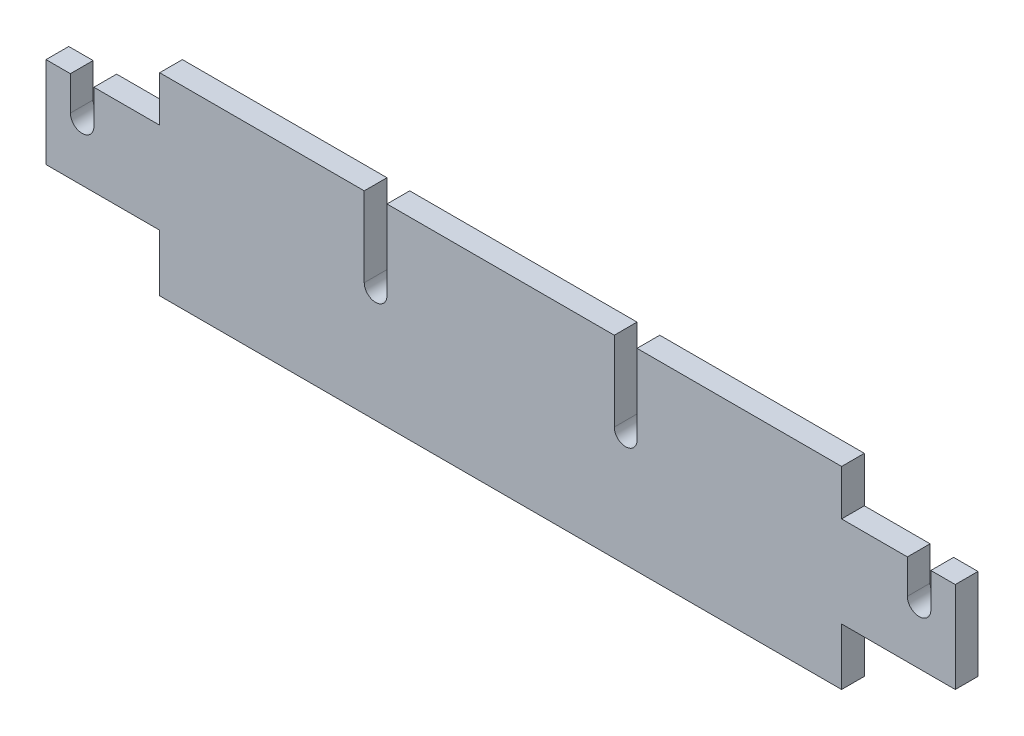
ISO-10303-21;
HEADER;
FILE_DESCRIPTION(('STEP AP214'),'2;1');
FILE_NAME('part.step','',(''),(''),'','','');
FILE_SCHEMA(('AUTOMOTIVE_DESIGN { 1 0 10303 214 1 1 1 1 }'));
ENDSEC;
DATA;
#1=APPLICATION_CONTEXT('core data for automotive mechanical design processes');
#2=APPLICATION_PROTOCOL_DEFINITION('international standard','automotive_design',2000,#1);
#3=PRODUCT_CONTEXT('',#1,'mechanical');
#4=PRODUCT('Part','Part','',(#3));
#5=PRODUCT_RELATED_PRODUCT_CATEGORY('part','',(#4));
#6=PRODUCT_DEFINITION_FORMATION('','',#4);
#7=PRODUCT_DEFINITION_CONTEXT('part definition',#1,'design');
#8=PRODUCT_DEFINITION('design','',#6,#7);
#9=PRODUCT_DEFINITION_SHAPE('','',#8);
#10=(LENGTH_UNIT() NAMED_UNIT(*) SI_UNIT(.MILLI.,.METRE.));
#11=(NAMED_UNIT(*) PLANE_ANGLE_UNIT() SI_UNIT($,.RADIAN.));
#12=(NAMED_UNIT(*) SI_UNIT($,.STERADIAN.) SOLID_ANGLE_UNIT());
#13=UNCERTAINTY_MEASURE_WITH_UNIT(LENGTH_MEASURE(1.E-05),#10,'distance_accuracy_value','');
#14=(GEOMETRIC_REPRESENTATION_CONTEXT(3) GLOBAL_UNCERTAINTY_ASSIGNED_CONTEXT((#13)) GLOBAL_UNIT_ASSIGNED_CONTEXT((#10,
#11,#12)) REPRESENTATION_CONTEXT('',''));
#15=CARTESIAN_POINT('',(0.,0.,0.));
#16=DIRECTION('',(0.,0.,1.));
#17=DIRECTION('',(1.,0.,0.));
#18=AXIS2_PLACEMENT_3D('',#15,#16,#17);
#19=CARTESIAN_POINT('',(-35.786768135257,0.,2.));
#20=DIRECTION('',(1.,0.,0.));
#21=DIRECTION('',(0.,0.,-1.));
#22=AXIS2_PLACEMENT_3D('',#19,#20,#21);
#23=PLANE('',#22);
#24=DIRECTION('',(0.,-1.,0.));
#25=VECTOR('',#24,1.);
#26=CARTESIAN_POINT('',(-35.786768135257,0.,0.));
#27=LINE('',#26,#25);
#28=CARTESIAN_POINT('',(-35.786768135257,13.,0.));
#29=VERTEX_POINT('',#28);
#30=CARTESIAN_POINT('',(-35.786768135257,10.,0.));
#31=VERTEX_POINT('',#30);
#32=EDGE_CURVE('E251',#29,#31,#27,.T.);
#33=ORIENTED_EDGE('',*,*,#32,.T.);
#34=DIRECTION('',(0.,0.,-1.));
#35=VECTOR('',#34,1.);
#36=CARTESIAN_POINT('',(-35.786768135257,10.,2.));
#37=LINE('',#36,#35);
#38=CARTESIAN_POINT('',(-35.786768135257,10.,2.));
#39=VERTEX_POINT('',#38);
#40=EDGE_CURVE('E11',#39,#31,#37,.T.);
#41=ORIENTED_EDGE('',*,*,#40,.F.);
#42=DIRECTION('',(0.,-1.,0.));
#43=VECTOR('',#42,1.);
#44=CARTESIAN_POINT('',(-35.786768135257,0.,2.));
#45=LINE('',#44,#43);
#46=CARTESIAN_POINT('',(-35.786768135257,13.,2.));
#47=VERTEX_POINT('',#46);
#48=EDGE_CURVE('E394',#47,#39,#45,.T.);
#49=ORIENTED_EDGE('',*,*,#48,.F.);
#50=DIRECTION('',(0.,0.,-1.));
#51=VECTOR('',#50,1.);
#52=CARTESIAN_POINT('',(-35.786768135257,13.,2.));
#53=LINE('',#52,#51);
#54=EDGE_CURVE('E50',#47,#29,#53,.T.);
#55=ORIENTED_EDGE('',*,*,#54,.T.);
#56=EDGE_LOOP('',(#33,#41,#49,#55));
#57=FACE_BOUND('',#56,.T.);
#58=ADVANCED_FACE('F34',(#57),#23,.F.);
#59=CARTESIAN_POINT('',(-36.8202238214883,10.,2.));
#60=DIRECTION('',(0.,0.,-1.));
#61=DIRECTION('',(-1.,0.,0.));
#62=AXIS2_PLACEMENT_3D('',#59,#60,#61);
#63=CYLINDRICAL_SURFACE('',#62,1.0334556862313);
#64=CARTESIAN_POINT('',(-36.8202238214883,10.,0.));
#65=DIRECTION('',(0.,0.,1.));
#66=DIRECTION('',(1.,0.,0.));
#67=AXIS2_PLACEMENT_3D('',#64,#65,#66);
#68=CIRCLE('',#67,1.0334556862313);
#69=CARTESIAN_POINT('',(-37.8536795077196,10.,0.));
#70=VERTEX_POINT('',#69);
#71=EDGE_CURVE('E253',#31,#70,#68,.F.);
#72=ORIENTED_EDGE('',*,*,#71,.T.);
#73=DIRECTION('',(0.,0.,-1.));
#74=VECTOR('',#73,1.);
#75=CARTESIAN_POINT('',(-37.8536795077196,10.,2.));
#76=LINE('',#75,#74);
#77=CARTESIAN_POINT('',(-37.8536795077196,10.,2.));
#78=VERTEX_POINT('',#77);
#79=EDGE_CURVE('E42',#78,#70,#76,.T.);
#80=ORIENTED_EDGE('',*,*,#79,.F.);
#81=CARTESIAN_POINT('',(-36.8202238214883,10.,2.));
#82=DIRECTION('',(0.,0.,1.));
#83=DIRECTION('',(1.,0.,0.));
#84=AXIS2_PLACEMENT_3D('',#81,#82,#83);
#85=CIRCLE('',#84,1.0334556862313);
#86=EDGE_CURVE('E148',#39,#78,#85,.F.);
#87=ORIENTED_EDGE('',*,*,#86,.F.);
#88=ORIENTED_EDGE('',*,*,#40,.T.);
#89=EDGE_LOOP('',(#72,#80,#87,#88));
#90=FACE_BOUND('',#89,.T.);
#91=ADVANCED_FACE('F380',(#90),#63,.F.);
#92=CARTESIAN_POINT('',(-37.8536795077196,0.,2.));
#93=DIRECTION('',(1.,0.,0.));
#94=DIRECTION('',(0.,0.,-1.));
#95=AXIS2_PLACEMENT_3D('',#92,#93,#94);
#96=PLANE('',#95);
#97=DIRECTION('',(0.,-1.,0.));
#98=VECTOR('',#97,1.);
#99=CARTESIAN_POINT('',(-37.8536795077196,0.,0.));
#100=LINE('',#99,#98);
#101=CARTESIAN_POINT('',(-37.8536795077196,13.,0.));
#102=VERTEX_POINT('',#101);
#103=EDGE_CURVE('E256',#102,#70,#100,.T.);
#104=ORIENTED_EDGE('',*,*,#103,.F.);
#105=DIRECTION('',(0.,0.,-1.));
#106=VECTOR('',#105,1.);
#107=CARTESIAN_POINT('',(-37.8536795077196,13.,2.));
#108=LINE('',#107,#106);
#109=CARTESIAN_POINT('',(-37.8536795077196,13.,2.));
#110=VERTEX_POINT('',#109);
#111=EDGE_CURVE('E373',#110,#102,#108,.T.);
#112=ORIENTED_EDGE('',*,*,#111,.F.);
#113=DIRECTION('',(0.,-1.,0.));
#114=VECTOR('',#113,1.);
#115=CARTESIAN_POINT('',(-37.8536795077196,0.,2.));
#116=LINE('',#115,#114);
#117=EDGE_CURVE('E379',#110,#78,#116,.T.);
#118=ORIENTED_EDGE('',*,*,#117,.T.);
#119=ORIENTED_EDGE('',*,*,#79,.T.);
#120=EDGE_LOOP('',(#104,#112,#118,#119));
#121=FACE_BOUND('',#120,.T.);
#122=ADVANCED_FACE('F377',(#121),#96,.T.);
#123=CARTESIAN_POINT('',(0.,13.,2.));
#124=DIRECTION('',(0.,1.,0.));
#125=DIRECTION('',(-1.,0.,0.));
#126=AXIS2_PLACEMENT_3D('',#123,#124,#125);
#127=PLANE('',#126);
#128=DIRECTION('',(1.,0.,0.));
#129=VECTOR('',#128,1.);
#130=CARTESIAN_POINT('',(0.,13.,0.));
#131=LINE('',#130,#129);
#132=CARTESIAN_POINT('',(-40.,13.,0.));
#133=VERTEX_POINT('',#132);
#134=EDGE_CURVE('E259',#133,#102,#131,.T.);
#135=ORIENTED_EDGE('',*,*,#134,.F.);
#136=DIRECTION('',(0.,0.,-1.));
#137=VECTOR('',#136,1.);
#138=CARTESIAN_POINT('',(-40.,13.,2.));
#139=LINE('',#138,#137);
#140=CARTESIAN_POINT('',(-40.,13.,2.));
#141=VERTEX_POINT('',#140);
#142=EDGE_CURVE('E371',#141,#133,#139,.T.);
#143=ORIENTED_EDGE('',*,*,#142,.F.);
#144=DIRECTION('',(1.,0.,0.));
#145=VECTOR('',#144,1.);
#146=CARTESIAN_POINT('',(0.,13.,2.));
#147=LINE('',#146,#145);
#148=EDGE_CURVE('E248',#141,#110,#147,.T.);
#149=ORIENTED_EDGE('',*,*,#148,.T.);
#150=ORIENTED_EDGE('',*,*,#111,.T.);
#151=EDGE_LOOP('',(#135,#143,#149,#150));
#152=FACE_BOUND('',#151,.T.);
#153=ADVANCED_FACE('F387',(#152),#127,.T.);
#154=CARTESIAN_POINT('',(-40.,0.,2.));
#155=DIRECTION('',(-1.,0.,0.));
#156=DIRECTION('',(0.,0.,1.));
#157=AXIS2_PLACEMENT_3D('',#154,#155,#156);
#158=PLANE('',#157);
#159=DIRECTION('',(0.,1.,0.));
#160=VECTOR('',#159,1.);
#161=CARTESIAN_POINT('',(-40.,0.,0.));
#162=LINE('',#161,#160);
#163=CARTESIAN_POINT('',(-40.,5.00000000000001,0.));
#164=VERTEX_POINT('',#163);
#165=EDGE_CURVE('E262',#164,#133,#162,.T.);
#166=ORIENTED_EDGE('',*,*,#165,.F.);
#167=DIRECTION('',(0.,0.,-1.));
#168=VECTOR('',#167,1.);
#169=CARTESIAN_POINT('',(-40.,5.00000000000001,2.));
#170=LINE('',#169,#168);
#171=CARTESIAN_POINT('',(-40.,5.00000000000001,2.));
#172=VERTEX_POINT('',#171);
#173=EDGE_CURVE('E369',#172,#164,#170,.T.);
#174=ORIENTED_EDGE('',*,*,#173,.F.);
#175=DIRECTION('',(0.,1.,0.));
#176=VECTOR('',#175,1.);
#177=CARTESIAN_POINT('',(-40.,0.,2.));
#178=LINE('',#177,#176);
#179=EDGE_CURVE('E393',#172,#141,#178,.T.);
#180=ORIENTED_EDGE('',*,*,#179,.T.);
#181=ORIENTED_EDGE('',*,*,#142,.T.);
#182=EDGE_LOOP('',(#166,#174,#180,#181));
#183=FACE_BOUND('',#182,.T.);
#184=ADVANCED_FACE('F456',(#183),#158,.T.);
#185=CARTESIAN_POINT('',(0.,5.,2.));
#186=DIRECTION('',(0.,-1.,0.));
#187=DIRECTION('',(1.,0.,0.));
#188=AXIS2_PLACEMENT_3D('',#185,#186,#187);
#189=PLANE('',#188);
#190=DIRECTION('',(-1.,0.,0.));
#191=VECTOR('',#190,1.);
#192=CARTESIAN_POINT('',(0.,5.,0.));
#193=LINE('',#192,#191);
#194=CARTESIAN_POINT('',(-30.,5.00000000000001,0.));
#195=VERTEX_POINT('',#194);
#196=EDGE_CURVE('E266',#195,#164,#193,.T.);
#197=ORIENTED_EDGE('',*,*,#196,.F.);
#198=DIRECTION('',(0.,0.,-1.));
#199=VECTOR('',#198,1.);
#200=CARTESIAN_POINT('',(-30.,5.00000000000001,2.));
#201=LINE('',#200,#199);
#202=CARTESIAN_POINT('',(-30.,5.00000000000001,2.));
#203=VERTEX_POINT('',#202);
#204=EDGE_CURVE('E367',#203,#195,#201,.T.);
#205=ORIENTED_EDGE('',*,*,#204,.F.);
#206=DIRECTION('',(-1.,0.,0.));
#207=VECTOR('',#206,1.);
#208=CARTESIAN_POINT('',(0.,5.,2.));
#209=LINE('',#208,#207);
#210=EDGE_CURVE('E399',#203,#172,#209,.T.);
#211=ORIENTED_EDGE('',*,*,#210,.T.);
#212=ORIENTED_EDGE('',*,*,#173,.T.);
#213=EDGE_LOOP('',(#197,#205,#211,#212));
#214=FACE_BOUND('',#213,.T.);
#215=ADVANCED_FACE('F459',(#214),#189,.T.);
#216=CARTESIAN_POINT('',(-30.,0.,2.));
#217=DIRECTION('',(-1.,0.,0.));
#218=DIRECTION('',(0.,0.,1.));
#219=AXIS2_PLACEMENT_3D('',#216,#217,#218);
#220=PLANE('',#219);
#221=DIRECTION('',(0.,1.,0.));
#222=VECTOR('',#221,1.);
#223=CARTESIAN_POINT('',(-30.,0.,0.));
#224=LINE('',#223,#222);
#225=CARTESIAN_POINT('',(-30.,0.,0.));
#226=VERTEX_POINT('',#225);
#227=EDGE_CURVE('E269',#226,#195,#224,.T.);
#228=ORIENTED_EDGE('',*,*,#227,.F.);
#229=DIRECTION('',(0.,0.,-1.));
#230=VECTOR('',#229,1.);
#231=CARTESIAN_POINT('',(-30.,0.,2.));
#232=LINE('',#231,#230);
#233=CARTESIAN_POINT('',(-30.,0.,2.));
#234=VERTEX_POINT('',#233);
#235=EDGE_CURVE('E365',#234,#226,#232,.T.);
#236=ORIENTED_EDGE('',*,*,#235,.F.);
#237=DIRECTION('',(0.,1.,0.));
#238=VECTOR('',#237,1.);
#239=CARTESIAN_POINT('',(-30.,0.,2.));
#240=LINE('',#239,#238);
#241=EDGE_CURVE('E402',#234,#203,#240,.T.);
#242=ORIENTED_EDGE('',*,*,#241,.T.);
#243=ORIENTED_EDGE('',*,*,#204,.T.);
#244=EDGE_LOOP('',(#228,#236,#242,#243));
#245=FACE_BOUND('',#244,.T.);
#246=ADVANCED_FACE('F463',(#245),#220,.T.);
#247=CARTESIAN_POINT('',(0.,0.,2.));
#248=DIRECTION('',(0.,1.,0.));
#249=DIRECTION('',(0.,0.,1.));
#250=AXIS2_PLACEMENT_3D('',#247,#248,#249);
#251=PLANE('',#250);
#252=DIRECTION('',(1.,0.,0.));
#253=VECTOR('',#252,1.);
#254=CARTESIAN_POINT('',(0.,0.,0.));
#255=LINE('',#254,#253);
#256=CARTESIAN_POINT('',(30.,0.,0.));
#257=VERTEX_POINT('',#256);
#258=EDGE_CURVE('E272',#226,#257,#255,.T.);
#259=ORIENTED_EDGE('',*,*,#258,.T.);
#260=DIRECTION('',(0.,0.,-1.));
#261=VECTOR('',#260,1.);
#262=CARTESIAN_POINT('',(30.,0.,2.));
#263=LINE('',#262,#261);
#264=CARTESIAN_POINT('',(30.,0.,2.));
#265=VERTEX_POINT('',#264);
#266=EDGE_CURVE('E362',#265,#257,#263,.T.);
#267=ORIENTED_EDGE('',*,*,#266,.F.);
#268=DIRECTION('',(1.,0.,0.));
#269=VECTOR('',#268,1.);
#270=CARTESIAN_POINT('',(0.,0.,2.));
#271=LINE('',#270,#269);
#272=EDGE_CURVE('E405',#234,#265,#271,.T.);
#273=ORIENTED_EDGE('',*,*,#272,.F.);
#274=ORIENTED_EDGE('',*,*,#235,.T.);
#275=EDGE_LOOP('',(#259,#267,#273,#274));
#276=FACE_BOUND('',#275,.T.);
#277=ADVANCED_FACE('F467',(#276),#251,.F.);
#278=CARTESIAN_POINT('',(30.,0.,2.));
#279=DIRECTION('',(-1.,0.,0.));
#280=DIRECTION('',(0.,0.,1.));
#281=AXIS2_PLACEMENT_3D('',#278,#279,#280);
#282=PLANE('',#281);
#283=DIRECTION('',(0.,1.,0.));
#284=VECTOR('',#283,1.);
#285=CARTESIAN_POINT('',(30.,0.,0.));
#286=LINE('',#285,#284);
#287=CARTESIAN_POINT('',(30.,5.00000000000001,0.));
#288=VERTEX_POINT('',#287);
#289=EDGE_CURVE('E274',#257,#288,#286,.T.);
#290=ORIENTED_EDGE('',*,*,#289,.T.);
#291=DIRECTION('',(0.,0.,-1.));
#292=VECTOR('',#291,1.);
#293=CARTESIAN_POINT('',(30.,5.00000000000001,2.));
#294=LINE('',#293,#292);
#295=CARTESIAN_POINT('',(30.,5.00000000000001,2.));
#296=VERTEX_POINT('',#295);
#297=EDGE_CURVE('E359',#296,#288,#294,.T.);
#298=ORIENTED_EDGE('',*,*,#297,.F.);
#299=DIRECTION('',(0.,1.,0.));
#300=VECTOR('',#299,1.);
#301=CARTESIAN_POINT('',(30.,0.,2.));
#302=LINE('',#301,#300);
#303=EDGE_CURVE('E407',#265,#296,#302,.T.);
#304=ORIENTED_EDGE('',*,*,#303,.F.);
#305=ORIENTED_EDGE('',*,*,#266,.T.);
#306=EDGE_LOOP('',(#290,#298,#304,#305));
#307=FACE_BOUND('',#306,.T.);
#308=ADVANCED_FACE('F471',(#307),#282,.F.);
#309=CARTESIAN_POINT('',(0.,5.,2.));
#310=DIRECTION('',(0.,1.,0.));
#311=DIRECTION('',(-1.,0.,0.));
#312=AXIS2_PLACEMENT_3D('',#309,#310,#311);
#313=PLANE('',#312);
#314=DIRECTION('',(1.,0.,0.));
#315=VECTOR('',#314,1.);
#316=CARTESIAN_POINT('',(0.,5.,0.));
#317=LINE('',#316,#315);
#318=CARTESIAN_POINT('',(40.,5.00000000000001,0.));
#319=VERTEX_POINT('',#318);
#320=EDGE_CURVE('E276',#288,#319,#317,.T.);
#321=ORIENTED_EDGE('',*,*,#320,.T.);
#322=DIRECTION('',(0.,0.,-1.));
#323=VECTOR('',#322,1.);
#324=CARTESIAN_POINT('',(40.,5.00000000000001,2.));
#325=LINE('',#324,#323);
#326=CARTESIAN_POINT('',(40.,5.00000000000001,2.));
#327=VERTEX_POINT('',#326);
#328=EDGE_CURVE('E356',#327,#319,#325,.T.);
#329=ORIENTED_EDGE('',*,*,#328,.F.);
#330=DIRECTION('',(1.,0.,0.));
#331=VECTOR('',#330,1.);
#332=CARTESIAN_POINT('',(0.,5.,2.));
#333=LINE('',#332,#331);
#334=EDGE_CURVE('E409',#296,#327,#333,.T.);
#335=ORIENTED_EDGE('',*,*,#334,.F.);
#336=ORIENTED_EDGE('',*,*,#297,.T.);
#337=EDGE_LOOP('',(#321,#329,#335,#336));
#338=FACE_BOUND('',#337,.T.);
#339=ADVANCED_FACE('F475',(#338),#313,.F.);
#340=CARTESIAN_POINT('',(40.,0.,2.));
#341=DIRECTION('',(-1.,0.,0.));
#342=DIRECTION('',(0.,0.,1.));
#343=AXIS2_PLACEMENT_3D('',#340,#341,#342);
#344=PLANE('',#343);
#345=DIRECTION('',(0.,1.,0.));
#346=VECTOR('',#345,1.);
#347=CARTESIAN_POINT('',(40.,0.,0.));
#348=LINE('',#347,#346);
#349=CARTESIAN_POINT('',(40.,13.,0.));
#350=VERTEX_POINT('',#349);
#351=EDGE_CURVE('E278',#319,#350,#348,.T.);
#352=ORIENTED_EDGE('',*,*,#351,.T.);
#353=DIRECTION('',(0.,0.,-1.));
#354=VECTOR('',#353,1.);
#355=CARTESIAN_POINT('',(40.,13.,2.));
#356=LINE('',#355,#354);
#357=CARTESIAN_POINT('',(40.,13.,2.));
#358=VERTEX_POINT('',#357);
#359=EDGE_CURVE('E353',#358,#350,#356,.T.);
#360=ORIENTED_EDGE('',*,*,#359,.F.);
#361=DIRECTION('',(0.,1.,0.));
#362=VECTOR('',#361,1.);
#363=CARTESIAN_POINT('',(40.,0.,2.));
#364=LINE('',#363,#362);
#365=EDGE_CURVE('E411',#327,#358,#364,.T.);
#366=ORIENTED_EDGE('',*,*,#365,.F.);
#367=ORIENTED_EDGE('',*,*,#328,.T.);
#368=EDGE_LOOP('',(#352,#360,#366,#367));
#369=FACE_BOUND('',#368,.T.);
#370=ADVANCED_FACE('F479',(#369),#344,.F.);
#371=CARTESIAN_POINT('',(0.,13.,2.));
#372=DIRECTION('',(0.,-1.,0.));
#373=DIRECTION('',(1.,0.,0.));
#374=AXIS2_PLACEMENT_3D('',#371,#372,#373);
#375=PLANE('',#374);
#376=DIRECTION('',(-1.,0.,0.));
#377=VECTOR('',#376,1.);
#378=CARTESIAN_POINT('',(0.,13.,0.));
#379=LINE('',#378,#377);
#380=CARTESIAN_POINT('',(37.8536795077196,13.,0.));
#381=VERTEX_POINT('',#380);
#382=EDGE_CURVE('E280',#350,#381,#379,.T.);
#383=ORIENTED_EDGE('',*,*,#382,.T.);
#384=DIRECTION('',(0.,0.,-1.));
#385=VECTOR('',#384,1.);
#386=CARTESIAN_POINT('',(37.8536795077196,13.,2.));
#387=LINE('',#386,#385);
#388=CARTESIAN_POINT('',(37.8536795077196,13.,2.));
#389=VERTEX_POINT('',#388);
#390=EDGE_CURVE('E350',#389,#381,#387,.T.);
#391=ORIENTED_EDGE('',*,*,#390,.F.);
#392=DIRECTION('',(-1.,0.,0.));
#393=VECTOR('',#392,1.);
#394=CARTESIAN_POINT('',(0.,13.,2.));
#395=LINE('',#394,#393);
#396=EDGE_CURVE('E413',#358,#389,#395,.T.);
#397=ORIENTED_EDGE('',*,*,#396,.F.);
#398=ORIENTED_EDGE('',*,*,#359,.T.);
#399=EDGE_LOOP('',(#383,#391,#397,#398));
#400=FACE_BOUND('',#399,.T.);
#401=ADVANCED_FACE('F483',(#400),#375,.F.);
#402=CARTESIAN_POINT('',(37.8536795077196,0.,2.));
#403=DIRECTION('',(1.,0.,0.));
#404=DIRECTION('',(0.,0.,-1.));
#405=AXIS2_PLACEMENT_3D('',#402,#403,#404);
#406=PLANE('',#405);
#407=DIRECTION('',(0.,-1.,0.));
#408=VECTOR('',#407,1.);
#409=CARTESIAN_POINT('',(37.8536795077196,0.,0.));
#410=LINE('',#409,#408);
#411=CARTESIAN_POINT('',(37.8536795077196,10.,0.));
#412=VERTEX_POINT('',#411);
#413=EDGE_CURVE('E282',#381,#412,#410,.T.);
#414=ORIENTED_EDGE('',*,*,#413,.T.);
#415=DIRECTION('',(0.,0.,-1.));
#416=VECTOR('',#415,1.);
#417=CARTESIAN_POINT('',(37.8536795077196,10.,2.));
#418=LINE('',#417,#416);
#419=CARTESIAN_POINT('',(37.8536795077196,10.,2.));
#420=VERTEX_POINT('',#419);
#421=EDGE_CURVE('E348',#420,#412,#418,.T.);
#422=ORIENTED_EDGE('',*,*,#421,.F.);
#423=DIRECTION('',(0.,-1.,0.));
#424=VECTOR('',#423,1.);
#425=CARTESIAN_POINT('',(37.8536795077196,0.,2.));
#426=LINE('',#425,#424);
#427=EDGE_CURVE('E415',#389,#420,#426,.T.);
#428=ORIENTED_EDGE('',*,*,#427,.F.);
#429=ORIENTED_EDGE('',*,*,#390,.T.);
#430=EDGE_LOOP('',(#414,#422,#428,#429));
#431=FACE_BOUND('',#430,.T.);
#432=ADVANCED_FACE('F485',(#431),#406,.F.);
#433=CARTESIAN_POINT('',(36.8202238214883,10.,2.));
#434=DIRECTION('',(0.,0.,-1.));
#435=DIRECTION('',(-1.,0.,0.));
#436=AXIS2_PLACEMENT_3D('',#433,#434,#435);
#437=CYLINDRICAL_SURFACE('',#436,1.0334556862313);
#438=CARTESIAN_POINT('',(36.8202238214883,10.,0.));
#439=DIRECTION('',(0.,0.,1.));
#440=DIRECTION('',(1.,0.,0.));
#441=AXIS2_PLACEMENT_3D('',#438,#439,#440);
#442=CIRCLE('',#441,1.0334556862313);
#443=CARTESIAN_POINT('',(35.786768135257,10.,0.));
#444=VERTEX_POINT('',#443);
#445=EDGE_CURVE('E286',#444,#412,#442,.T.);
#446=ORIENTED_EDGE('',*,*,#445,.F.);
#447=DIRECTION('',(0.,0.,-1.));
#448=VECTOR('',#447,1.);
#449=CARTESIAN_POINT('',(35.786768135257,10.,2.));
#450=LINE('',#449,#448);
#451=CARTESIAN_POINT('',(35.786768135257,10.,2.));
#452=VERTEX_POINT('',#451);
#453=EDGE_CURVE('E346',#452,#444,#450,.T.);
#454=ORIENTED_EDGE('',*,*,#453,.F.);
#455=CARTESIAN_POINT('',(36.8202238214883,10.,2.));
#456=DIRECTION('',(0.,0.,1.));
#457=DIRECTION('',(1.,0.,0.));
#458=AXIS2_PLACEMENT_3D('',#455,#456,#457);
#459=CIRCLE('',#458,1.0334556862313);
#460=EDGE_CURVE('E418',#452,#420,#459,.T.);
#461=ORIENTED_EDGE('',*,*,#460,.T.);
#462=ORIENTED_EDGE('',*,*,#421,.T.);
#463=EDGE_LOOP('',(#446,#454,#461,#462));
#464=FACE_BOUND('',#463,.T.);
#465=ADVANCED_FACE('F488',(#464),#437,.F.);
#466=CARTESIAN_POINT('',(35.786768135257,0.,2.));
#467=DIRECTION('',(1.,0.,0.));
#468=DIRECTION('',(0.,0.,-1.));
#469=AXIS2_PLACEMENT_3D('',#466,#467,#468);
#470=PLANE('',#469);
#471=DIRECTION('',(0.,-1.,0.));
#472=VECTOR('',#471,1.);
#473=CARTESIAN_POINT('',(35.786768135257,0.,0.));
#474=LINE('',#473,#472);
#475=CARTESIAN_POINT('',(35.786768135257,13.,0.));
#476=VERTEX_POINT('',#475);
#477=EDGE_CURVE('E289',#476,#444,#474,.T.);
#478=ORIENTED_EDGE('',*,*,#477,.F.);
#479=DIRECTION('',(0.,0.,-1.));
#480=VECTOR('',#479,1.);
#481=CARTESIAN_POINT('',(35.786768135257,13.,2.));
#482=LINE('',#481,#480);
#483=CARTESIAN_POINT('',(35.786768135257,13.,2.));
#484=VERTEX_POINT('',#483);
#485=EDGE_CURVE('E344',#484,#476,#482,.T.);
#486=ORIENTED_EDGE('',*,*,#485,.F.);
#487=DIRECTION('',(0.,-1.,0.));
#488=VECTOR('',#487,1.);
#489=CARTESIAN_POINT('',(35.786768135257,0.,2.));
#490=LINE('',#489,#488);
#491=EDGE_CURVE('E421',#484,#452,#490,.T.);
#492=ORIENTED_EDGE('',*,*,#491,.T.);
#493=ORIENTED_EDGE('',*,*,#453,.T.);
#494=EDGE_LOOP('',(#478,#486,#492,#493));
#495=FACE_BOUND('',#494,.T.);
#496=ADVANCED_FACE('F492',(#495),#470,.T.);
#497=CARTESIAN_POINT('',(30.,13.,0.));
#498=VERTEX_POINT('',#497);
#499=EDGE_CURVE('E283',#476,#498,#379,.T.);
#500=ORIENTED_EDGE('',*,*,#499,.T.);
#501=DIRECTION('',(0.,0.,-1.));
#502=VECTOR('',#501,1.);
#503=CARTESIAN_POINT('',(30.,13.,2.));
#504=LINE('',#503,#502);
#505=CARTESIAN_POINT('',(30.,13.,2.));
#506=VERTEX_POINT('',#505);
#507=EDGE_CURVE('E341',#506,#498,#504,.T.);
#508=ORIENTED_EDGE('',*,*,#507,.F.);
#509=EDGE_CURVE('E416',#484,#506,#395,.T.);
#510=ORIENTED_EDGE('',*,*,#509,.F.);
#511=ORIENTED_EDGE('',*,*,#485,.T.);
#512=EDGE_LOOP('',(#500,#508,#510,#511));
#513=FACE_BOUND('',#512,.T.);
#514=ADVANCED_FACE('F496',(#513),#375,.F.);
#515=CARTESIAN_POINT('',(30.,0.,2.));
#516=DIRECTION('',(-1.,0.,0.));
#517=DIRECTION('',(0.,-1.,0.));
#518=AXIS2_PLACEMENT_3D('',#515,#516,#517);
#519=PLANE('',#518);
#520=DIRECTION('',(0.,1.,0.));
#521=VECTOR('',#520,1.);
#522=CARTESIAN_POINT('',(30.,0.,0.));
#523=LINE('',#522,#521);
#524=CARTESIAN_POINT('',(30.,17.,0.));
#525=VERTEX_POINT('',#524);
#526=EDGE_CURVE('E292',#498,#525,#523,.T.);
#527=ORIENTED_EDGE('',*,*,#526,.T.);
#528=DIRECTION('',(0.,0.,-1.));
#529=VECTOR('',#528,1.);
#530=CARTESIAN_POINT('',(30.,17.,2.));
#531=LINE('',#530,#529);
#532=CARTESIAN_POINT('',(30.,17.,2.));
#533=VERTEX_POINT('',#532);
#534=EDGE_CURVE('E338',#533,#525,#531,.T.);
#535=ORIENTED_EDGE('',*,*,#534,.F.);
#536=DIRECTION('',(0.,1.,0.));
#537=VECTOR('',#536,1.);
#538=CARTESIAN_POINT('',(30.,0.,2.));
#539=LINE('',#538,#537);
#540=EDGE_CURVE('E424',#506,#533,#539,.T.);
#541=ORIENTED_EDGE('',*,*,#540,.F.);
#542=ORIENTED_EDGE('',*,*,#507,.T.);
#543=EDGE_LOOP('',(#527,#535,#541,#542));
#544=FACE_BOUND('',#543,.T.);
#545=ADVANCED_FACE('F500',(#544),#519,.F.);
#546=CARTESIAN_POINT('',(0.,17.,2.));
#547=DIRECTION('',(0.,-1.,0.));
#548=DIRECTION('',(1.,0.,0.));
#549=AXIS2_PLACEMENT_3D('',#546,#547,#548);
#550=PLANE('',#549);
#551=DIRECTION('',(-1.,0.,0.));
#552=VECTOR('',#551,1.);
#553=CARTESIAN_POINT('',(0.,17.,0.));
#554=LINE('',#553,#552);
#555=CARTESIAN_POINT('',(12.,17.,0.));
#556=VERTEX_POINT('',#555);
#557=EDGE_CURVE('E294',#525,#556,#554,.T.);
#558=ORIENTED_EDGE('',*,*,#557,.T.);
#559=DIRECTION('',(0.,0.,-1.));
#560=VECTOR('',#559,1.);
#561=CARTESIAN_POINT('',(12.,17.,2.));
#562=LINE('',#561,#560);
#563=CARTESIAN_POINT('',(12.,17.,2.));
#564=VERTEX_POINT('',#563);
#565=EDGE_CURVE('E335',#564,#556,#562,.T.);
#566=ORIENTED_EDGE('',*,*,#565,.F.);
#567=DIRECTION('',(-1.,0.,0.));
#568=VECTOR('',#567,1.);
#569=CARTESIAN_POINT('',(0.,17.,2.));
#570=LINE('',#569,#568);
#571=EDGE_CURVE('E426',#533,#564,#570,.T.);
#572=ORIENTED_EDGE('',*,*,#571,.F.);
#573=ORIENTED_EDGE('',*,*,#534,.T.);
#574=EDGE_LOOP('',(#558,#566,#572,#573));
#575=FACE_BOUND('',#574,.T.);
#576=ADVANCED_FACE('F504',(#575),#550,.F.);
#577=CARTESIAN_POINT('',(12.,0.,2.));
#578=DIRECTION('',(1.,0.,0.));
#579=DIRECTION('',(0.,0.,-1.));
#580=AXIS2_PLACEMENT_3D('',#577,#578,#579);
#581=PLANE('',#580);
#582=DIRECTION('',(0.,-1.,0.));
#583=VECTOR('',#582,1.);
#584=CARTESIAN_POINT('',(12.,0.,0.));
#585=LINE('',#584,#583);
#586=CARTESIAN_POINT('',(12.,10.,0.));
#587=VERTEX_POINT('',#586);
#588=EDGE_CURVE('E296',#556,#587,#585,.T.);
#589=ORIENTED_EDGE('',*,*,#588,.T.);
#590=DIRECTION('',(0.,0.,-1.));
#591=VECTOR('',#590,1.);
#592=CARTESIAN_POINT('',(12.,10.,2.));
#593=LINE('',#592,#591);
#594=CARTESIAN_POINT('',(12.,10.,2.));
#595=VERTEX_POINT('',#594);
#596=EDGE_CURVE('E333',#595,#587,#593,.T.);
#597=ORIENTED_EDGE('',*,*,#596,.F.);
#598=DIRECTION('',(0.,-1.,0.));
#599=VECTOR('',#598,1.);
#600=CARTESIAN_POINT('',(12.,0.,2.));
#601=LINE('',#600,#599);
#602=EDGE_CURVE('E428',#564,#595,#601,.T.);
#603=ORIENTED_EDGE('',*,*,#602,.F.);
#604=ORIENTED_EDGE('',*,*,#565,.T.);
#605=EDGE_LOOP('',(#589,#597,#603,#604));
#606=FACE_BOUND('',#605,.T.);
#607=ADVANCED_FACE('F508',(#606),#581,.F.);
#608=CARTESIAN_POINT('',(11.,10.,2.));
#609=DIRECTION('',(0.,0.,-1.));
#610=DIRECTION('',(-1.,0.,0.));
#611=AXIS2_PLACEMENT_3D('',#608,#609,#610);
#612=CYLINDRICAL_SURFACE('',#611,0.999999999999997);
#613=CARTESIAN_POINT('',(11.,10.,0.));
#614=DIRECTION('',(0.,0.,1.));
#615=DIRECTION('',(1.,0.,0.));
#616=AXIS2_PLACEMENT_3D('',#613,#614,#615);
#617=CIRCLE('',#616,0.999999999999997);
#618=CARTESIAN_POINT('',(10.,10.,0.));
#619=VERTEX_POINT('',#618);
#620=EDGE_CURVE('E299',#619,#587,#617,.T.);
#621=ORIENTED_EDGE('',*,*,#620,.F.);
#622=DIRECTION('',(0.,0.,-1.));
#623=VECTOR('',#622,1.);
#624=CARTESIAN_POINT('',(10.,10.,2.));
#625=LINE('',#624,#623);
#626=CARTESIAN_POINT('',(10.,10.,2.));
#627=VERTEX_POINT('',#626);
#628=EDGE_CURVE('E331',#627,#619,#625,.T.);
#629=ORIENTED_EDGE('',*,*,#628,.F.);
#630=CARTESIAN_POINT('',(11.,10.,2.));
#631=DIRECTION('',(0.,0.,1.));
#632=DIRECTION('',(1.,0.,0.));
#633=AXIS2_PLACEMENT_3D('',#630,#631,#632);
#634=CIRCLE('',#633,0.999999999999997);
#635=EDGE_CURVE('E430',#627,#595,#634,.T.);
#636=ORIENTED_EDGE('',*,*,#635,.T.);
#637=ORIENTED_EDGE('',*,*,#596,.T.);
#638=EDGE_LOOP('',(#621,#629,#636,#637));
#639=FACE_BOUND('',#638,.T.);
#640=ADVANCED_FACE('F512',(#639),#612,.F.);
#641=CARTESIAN_POINT('',(10.,0.,2.));
#642=DIRECTION('',(1.,0.,0.));
#643=DIRECTION('',(0.,1.,0.));
#644=AXIS2_PLACEMENT_3D('',#641,#642,#643);
#645=PLANE('',#644);
#646=DIRECTION('',(0.,-1.,0.));
#647=VECTOR('',#646,1.);
#648=CARTESIAN_POINT('',(10.,0.,0.));
#649=LINE('',#648,#647);
#650=CARTESIAN_POINT('',(10.,17.,0.));
#651=VERTEX_POINT('',#650);
#652=EDGE_CURVE('E302',#651,#619,#649,.T.);
#653=ORIENTED_EDGE('',*,*,#652,.F.);
#654=DIRECTION('',(0.,0.,-1.));
#655=VECTOR('',#654,1.);
#656=CARTESIAN_POINT('',(10.,17.,2.));
#657=LINE('',#656,#655);
#658=CARTESIAN_POINT('',(10.,17.,2.));
#659=VERTEX_POINT('',#658);
#660=EDGE_CURVE('E329',#659,#651,#657,.T.);
#661=ORIENTED_EDGE('',*,*,#660,.F.);
#662=DIRECTION('',(0.,-1.,0.));
#663=VECTOR('',#662,1.);
#664=CARTESIAN_POINT('',(10.,0.,2.));
#665=LINE('',#664,#663);
#666=EDGE_CURVE('E433',#659,#627,#665,.T.);
#667=ORIENTED_EDGE('',*,*,#666,.T.);
#668=ORIENTED_EDGE('',*,*,#628,.T.);
#669=EDGE_LOOP('',(#653,#661,#667,#668));
#670=FACE_BOUND('',#669,.T.);
#671=ADVANCED_FACE('F516',(#670),#645,.T.);
#672=CARTESIAN_POINT('',(0.,17.,2.));
#673=DIRECTION('',(0.,-1.,0.));
#674=DIRECTION('',(0.,0.,-1.));
#675=AXIS2_PLACEMENT_3D('',#672,#673,#674);
#676=PLANE('',#675);
#677=DIRECTION('',(-1.,0.,0.));
#678=VECTOR('',#677,1.);
#679=CARTESIAN_POINT('',(0.,17.,0.));
#680=LINE('',#679,#678);
#681=CARTESIAN_POINT('',(-10.,17.,0.));
#682=VERTEX_POINT('',#681);
#683=EDGE_CURVE('E305',#651,#682,#680,.T.);
#684=ORIENTED_EDGE('',*,*,#683,.T.);
#685=DIRECTION('',(0.,0.,-1.));
#686=VECTOR('',#685,1.);
#687=CARTESIAN_POINT('',(-10.,17.,2.));
#688=LINE('',#687,#686);
#689=CARTESIAN_POINT('',(-10.,17.,2.));
#690=VERTEX_POINT('',#689);
#691=EDGE_CURVE('E326',#690,#682,#688,.T.);
#692=ORIENTED_EDGE('',*,*,#691,.F.);
#693=DIRECTION('',(-1.,0.,0.));
#694=VECTOR('',#693,1.);
#695=CARTESIAN_POINT('',(0.,17.,2.));
#696=LINE('',#695,#694);
#697=EDGE_CURVE('E436',#659,#690,#696,.T.);
#698=ORIENTED_EDGE('',*,*,#697,.F.);
#699=ORIENTED_EDGE('',*,*,#660,.T.);
#700=EDGE_LOOP('',(#684,#692,#698,#699));
#701=FACE_BOUND('',#700,.T.);
#702=ADVANCED_FACE('F520',(#701),#676,.F.);
#703=CARTESIAN_POINT('',(-10.,0.,2.));
#704=DIRECTION('',(1.,0.,0.));
#705=DIRECTION('',(0.,1.,0.));
#706=AXIS2_PLACEMENT_3D('',#703,#704,#705);
#707=PLANE('',#706);
#708=DIRECTION('',(0.,-1.,0.));
#709=VECTOR('',#708,1.);
#710=CARTESIAN_POINT('',(-10.,0.,0.));
#711=LINE('',#710,#709);
#712=CARTESIAN_POINT('',(-10.,10.,0.));
#713=VERTEX_POINT('',#712);
#714=EDGE_CURVE('E307',#682,#713,#711,.T.);
#715=ORIENTED_EDGE('',*,*,#714,.T.);
#716=DIRECTION('',(0.,0.,-1.));
#717=VECTOR('',#716,1.);
#718=CARTESIAN_POINT('',(-10.,10.,2.));
#719=LINE('',#718,#717);
#720=CARTESIAN_POINT('',(-10.,10.,2.));
#721=VERTEX_POINT('',#720);
#722=EDGE_CURVE('E323',#721,#713,#719,.T.);
#723=ORIENTED_EDGE('',*,*,#722,.F.);
#724=DIRECTION('',(0.,-1.,0.));
#725=VECTOR('',#724,1.);
#726=CARTESIAN_POINT('',(-10.,0.,2.));
#727=LINE('',#726,#725);
#728=EDGE_CURVE('E438',#690,#721,#727,.T.);
#729=ORIENTED_EDGE('',*,*,#728,.F.);
#730=ORIENTED_EDGE('',*,*,#691,.T.);
#731=EDGE_LOOP('',(#715,#723,#729,#730));
#732=FACE_BOUND('',#731,.T.);
#733=ADVANCED_FACE('F524',(#732),#707,.F.);
#734=CARTESIAN_POINT('',(-11.,10.,2.));
#735=DIRECTION('',(0.,0.,-1.));
#736=DIRECTION('',(-1.,0.,0.));
#737=AXIS2_PLACEMENT_3D('',#734,#735,#736);
#738=CYLINDRICAL_SURFACE('',#737,0.999999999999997);
#739=CARTESIAN_POINT('',(-11.,10.,0.));
#740=DIRECTION('',(0.,0.,1.));
#741=DIRECTION('',(1.,0.,0.));
#742=AXIS2_PLACEMENT_3D('',#739,#740,#741);
#743=CIRCLE('',#742,0.999999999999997);
#744=CARTESIAN_POINT('',(-12.,10.,0.));
#745=VERTEX_POINT('',#744);
#746=EDGE_CURVE('E309',#713,#745,#743,.F.);
#747=ORIENTED_EDGE('',*,*,#746,.T.);
#748=DIRECTION('',(0.,0.,-1.));
#749=VECTOR('',#748,1.);
#750=CARTESIAN_POINT('',(-12.,10.,2.));
#751=LINE('',#750,#749);
#752=CARTESIAN_POINT('',(-12.,10.,2.));
#753=VERTEX_POINT('',#752);
#754=EDGE_CURVE('E321',#753,#745,#751,.T.);
#755=ORIENTED_EDGE('',*,*,#754,.F.);
#756=CARTESIAN_POINT('',(-11.,10.,2.));
#757=DIRECTION('',(0.,0.,1.));
#758=DIRECTION('',(1.,0.,0.));
#759=AXIS2_PLACEMENT_3D('',#756,#757,#758);
#760=CIRCLE('',#759,0.999999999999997);
#761=EDGE_CURVE('E440',#721,#753,#760,.F.);
#762=ORIENTED_EDGE('',*,*,#761,.F.);
#763=ORIENTED_EDGE('',*,*,#722,.T.);
#764=EDGE_LOOP('',(#747,#755,#762,#763));
#765=FACE_BOUND('',#764,.T.);
#766=ADVANCED_FACE('F528',(#765),#738,.F.);
#767=CARTESIAN_POINT('',(-12.,0.,2.));
#768=DIRECTION('',(1.,0.,0.));
#769=DIRECTION('',(0.,0.,-1.));
#770=AXIS2_PLACEMENT_3D('',#767,#768,#769);
#771=PLANE('',#770);
#772=DIRECTION('',(0.,-1.,0.));
#773=VECTOR('',#772,1.);
#774=CARTESIAN_POINT('',(-12.,0.,0.));
#775=LINE('',#774,#773);
#776=CARTESIAN_POINT('',(-12.,17.,0.));
#777=VERTEX_POINT('',#776);
#778=EDGE_CURVE('E312',#777,#745,#775,.T.);
#779=ORIENTED_EDGE('',*,*,#778,.F.);
#780=DIRECTION('',(0.,0.,-1.));
#781=VECTOR('',#780,1.);
#782=CARTESIAN_POINT('',(-12.,17.,2.));
#783=LINE('',#782,#781);
#784=CARTESIAN_POINT('',(-12.,17.,2.));
#785=VERTEX_POINT('',#784);
#786=EDGE_CURVE('E233',#785,#777,#783,.T.);
#787=ORIENTED_EDGE('',*,*,#786,.F.);
#788=DIRECTION('',(0.,-1.,0.));
#789=VECTOR('',#788,1.);
#790=CARTESIAN_POINT('',(-12.,0.,2.));
#791=LINE('',#790,#789);
#792=EDGE_CURVE('E242',#785,#753,#791,.T.);
#793=ORIENTED_EDGE('',*,*,#792,.T.);
#794=ORIENTED_EDGE('',*,*,#754,.T.);
#795=EDGE_LOOP('',(#779,#787,#793,#794));
#796=FACE_BOUND('',#795,.T.);
#797=ADVANCED_FACE('F443',(#796),#771,.T.);
#798=CARTESIAN_POINT('',(0.,17.,2.));
#799=DIRECTION('',(0.,1.,0.));
#800=DIRECTION('',(-1.,0.,0.));
#801=AXIS2_PLACEMENT_3D('',#798,#799,#800);
#802=PLANE('',#801);
#803=DIRECTION('',(1.,0.,0.));
#804=VECTOR('',#803,1.);
#805=CARTESIAN_POINT('',(0.,17.,0.));
#806=LINE('',#805,#804);
#807=CARTESIAN_POINT('',(-30.,17.,0.));
#808=VERTEX_POINT('',#807);
#809=EDGE_CURVE('E229',#808,#777,#806,.T.);
#810=ORIENTED_EDGE('',*,*,#809,.F.);
#811=DIRECTION('',(0.,0.,-1.));
#812=VECTOR('',#811,1.);
#813=CARTESIAN_POINT('',(-30.,17.,2.));
#814=LINE('',#813,#812);
#815=CARTESIAN_POINT('',(-30.,17.,2.));
#816=VERTEX_POINT('',#815);
#817=EDGE_CURVE('E224',#816,#808,#814,.T.);
#818=ORIENTED_EDGE('',*,*,#817,.F.);
#819=DIRECTION('',(1.,0.,0.));
#820=VECTOR('',#819,1.);
#821=CARTESIAN_POINT('',(0.,17.,2.));
#822=LINE('',#821,#820);
#823=EDGE_CURVE('E227',#816,#785,#822,.T.);
#824=ORIENTED_EDGE('',*,*,#823,.T.);
#825=ORIENTED_EDGE('',*,*,#786,.T.);
#826=EDGE_LOOP('',(#810,#818,#824,#825));
#827=FACE_BOUND('',#826,.T.);
#828=ADVANCED_FACE('F226',(#827),#802,.T.);
#829=CARTESIAN_POINT('',(-30.,0.,2.));
#830=DIRECTION('',(-1.,0.,0.));
#831=DIRECTION('',(0.,-1.,0.));
#832=AXIS2_PLACEMENT_3D('',#829,#830,#831);
#833=PLANE('',#832);
#834=DIRECTION('',(0.,1.,0.));
#835=VECTOR('',#834,1.);
#836=CARTESIAN_POINT('',(-30.,0.,0.));
#837=LINE('',#836,#835);
#838=CARTESIAN_POINT('',(-30.,13.,0.));
#839=VERTEX_POINT('',#838);
#840=EDGE_CURVE('E316',#839,#808,#837,.T.);
#841=ORIENTED_EDGE('',*,*,#840,.F.);
#842=DIRECTION('',(0.,0.,-1.));
#843=VECTOR('',#842,1.);
#844=CARTESIAN_POINT('',(-30.,13.,2.));
#845=LINE('',#844,#843);
#846=CARTESIAN_POINT('',(-30.,13.,2.));
#847=VERTEX_POINT('',#846);
#848=EDGE_CURVE('E136',#847,#839,#845,.T.);
#849=ORIENTED_EDGE('',*,*,#848,.F.);
#850=DIRECTION('',(0.,1.,0.));
#851=VECTOR('',#850,1.);
#852=CARTESIAN_POINT('',(-30.,0.,2.));
#853=LINE('',#852,#851);
#854=EDGE_CURVE('E240',#847,#816,#853,.T.);
#855=ORIENTED_EDGE('',*,*,#854,.T.);
#856=ORIENTED_EDGE('',*,*,#817,.T.);
#857=EDGE_LOOP('',(#841,#849,#855,#856));
#858=FACE_BOUND('',#857,.T.);
#859=ADVANCED_FACE('F244',(#858),#833,.T.);
#860=EDGE_CURVE('E263',#29,#839,#131,.T.);
#861=ORIENTED_EDGE('',*,*,#860,.F.);
#862=ORIENTED_EDGE('',*,*,#54,.F.);
#863=EDGE_CURVE('E245',#47,#847,#147,.T.);
#864=ORIENTED_EDGE('',*,*,#863,.T.);
#865=ORIENTED_EDGE('',*,*,#848,.T.);
#866=EDGE_LOOP('',(#861,#862,#864,#865));
#867=FACE_BOUND('',#866,.T.);
#868=ADVANCED_FACE('F539',(#867),#127,.T.);
#869=CARTESIAN_POINT('',(0.,0.,2.));
#870=DIRECTION('',(0.,0.,1.));
#871=DIRECTION('',(1.,0.,0.));
#872=AXIS2_PLACEMENT_3D('',#869,#870,#871);
#873=PLANE('',#872);
#874=ORIENTED_EDGE('',*,*,#48,.T.);
#875=ORIENTED_EDGE('',*,*,#86,.T.);
#876=ORIENTED_EDGE('',*,*,#117,.F.);
#877=ORIENTED_EDGE('',*,*,#148,.F.);
#878=ORIENTED_EDGE('',*,*,#179,.F.);
#879=ORIENTED_EDGE('',*,*,#210,.F.);
#880=ORIENTED_EDGE('',*,*,#241,.F.);
#881=ORIENTED_EDGE('',*,*,#272,.T.);
#882=ORIENTED_EDGE('',*,*,#303,.T.);
#883=ORIENTED_EDGE('',*,*,#334,.T.);
#884=ORIENTED_EDGE('',*,*,#365,.T.);
#885=ORIENTED_EDGE('',*,*,#396,.T.);
#886=ORIENTED_EDGE('',*,*,#427,.T.);
#887=ORIENTED_EDGE('',*,*,#460,.F.);
#888=ORIENTED_EDGE('',*,*,#491,.F.);
#889=ORIENTED_EDGE('',*,*,#509,.T.);
#890=ORIENTED_EDGE('',*,*,#540,.T.);
#891=ORIENTED_EDGE('',*,*,#571,.T.);
#892=ORIENTED_EDGE('',*,*,#602,.T.);
#893=ORIENTED_EDGE('',*,*,#635,.F.);
#894=ORIENTED_EDGE('',*,*,#666,.F.);
#895=ORIENTED_EDGE('',*,*,#697,.T.);
#896=ORIENTED_EDGE('',*,*,#728,.T.);
#897=ORIENTED_EDGE('',*,*,#761,.T.);
#898=ORIENTED_EDGE('',*,*,#792,.F.);
#899=ORIENTED_EDGE('',*,*,#823,.F.);
#900=ORIENTED_EDGE('',*,*,#854,.F.);
#901=ORIENTED_EDGE('',*,*,#863,.F.);
#902=EDGE_LOOP('',(#874,#875,#876,#877,#878,#879,#880,#881,#882,#883,#884,#885,#886,#887,#888,
#889,#890,#891,#892,#893,#894,#895,#896,#897,#898,#899,#900,#901));
#903=FACE_BOUND('',#902,.T.);
#904=ADVANCED_FACE('F238',(#903),#873,.T.);
#905=CARTESIAN_POINT('',(0.,0.,0.));
#906=DIRECTION('',(0.,0.,1.));
#907=DIRECTION('',(1.,0.,0.));
#908=AXIS2_PLACEMENT_3D('',#905,#906,#907);
#909=PLANE('',#908);
#910=ORIENTED_EDGE('',*,*,#32,.F.);
#911=ORIENTED_EDGE('',*,*,#860,.T.);
#912=ORIENTED_EDGE('',*,*,#840,.T.);
#913=ORIENTED_EDGE('',*,*,#809,.T.);
#914=ORIENTED_EDGE('',*,*,#778,.T.);
#915=ORIENTED_EDGE('',*,*,#746,.F.);
#916=ORIENTED_EDGE('',*,*,#714,.F.);
#917=ORIENTED_EDGE('',*,*,#683,.F.);
#918=ORIENTED_EDGE('',*,*,#652,.T.);
#919=ORIENTED_EDGE('',*,*,#620,.T.);
#920=ORIENTED_EDGE('',*,*,#588,.F.);
#921=ORIENTED_EDGE('',*,*,#557,.F.);
#922=ORIENTED_EDGE('',*,*,#526,.F.);
#923=ORIENTED_EDGE('',*,*,#499,.F.);
#924=ORIENTED_EDGE('',*,*,#477,.T.);
#925=ORIENTED_EDGE('',*,*,#445,.T.);
#926=ORIENTED_EDGE('',*,*,#413,.F.);
#927=ORIENTED_EDGE('',*,*,#382,.F.);
#928=ORIENTED_EDGE('',*,*,#351,.F.);
#929=ORIENTED_EDGE('',*,*,#320,.F.);
#930=ORIENTED_EDGE('',*,*,#289,.F.);
#931=ORIENTED_EDGE('',*,*,#258,.F.);
#932=ORIENTED_EDGE('',*,*,#227,.T.);
#933=ORIENTED_EDGE('',*,*,#196,.T.);
#934=ORIENTED_EDGE('',*,*,#165,.T.);
#935=ORIENTED_EDGE('',*,*,#134,.T.);
#936=ORIENTED_EDGE('',*,*,#103,.T.);
#937=ORIENTED_EDGE('',*,*,#71,.F.);
#938=EDGE_LOOP('',(#910,#911,#912,#913,#914,#915,#916,#917,#918,#919,#920,#921,#922,#923,#924,
#925,#926,#927,#928,#929,#930,#931,#932,#933,#934,#935,#936,#937));
#939=FACE_BOUND('',#938,.T.);
#940=ADVANCED_FACE('F383',(#939),#909,.F.);
#941=CLOSED_SHELL('',(#58,#91,#122,#153,#184,#215,#246,#277,#308,#339,#370,#401,#432,#465,#496,
#514,#545,#576,#607,#640,#671,#702,#733,#766,#797,#828,#859,#868,#904,#940));
#942=MANIFOLD_SOLID_BREP('B2',#941);
#943=ADVANCED_BREP_SHAPE_REPRESENTATION('',(#18,#942),#14);
#944=SHAPE_DEFINITION_REPRESENTATION(#9,#943);
ENDSEC;
END-ISO-10303-21;
